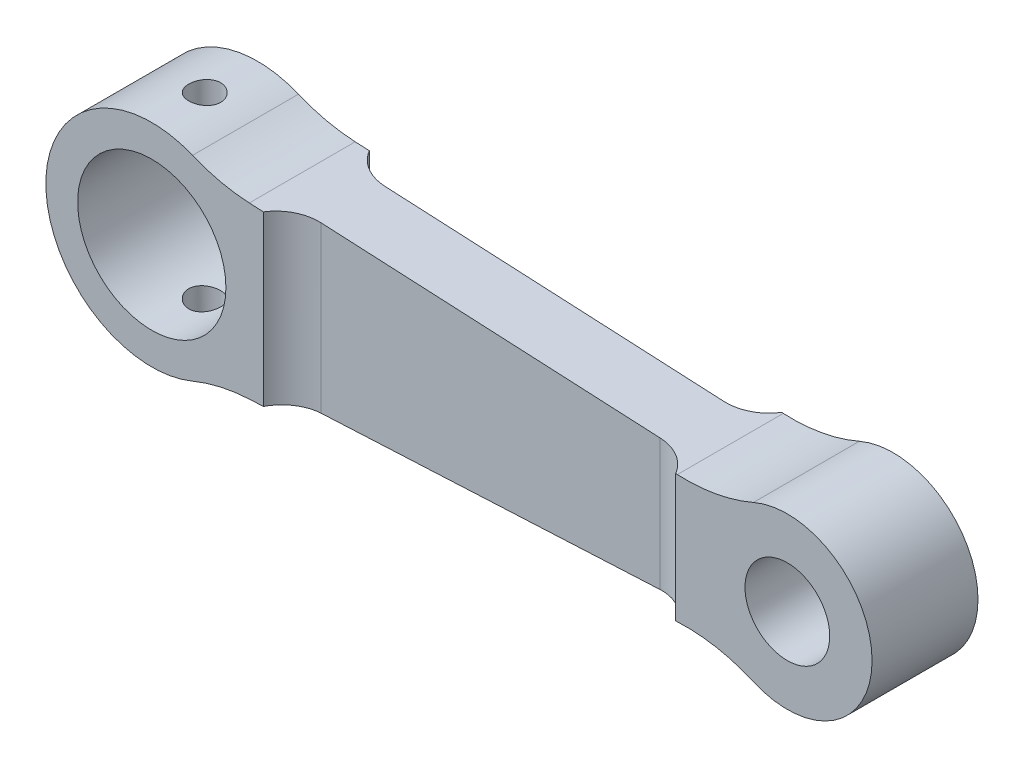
ISO-10303-21;
HEADER;
FILE_DESCRIPTION(('STEP AP214'),'2;1');
FILE_NAME('part.step','',(''),(''),'','','');
FILE_SCHEMA(('AUTOMOTIVE_DESIGN { 1 0 10303 214 1 1 1 1 }'));
ENDSEC;
DATA;
#1=APPLICATION_CONTEXT('core data for automotive mechanical design processes');
#2=APPLICATION_PROTOCOL_DEFINITION('international standard','automotive_design',2000,#1);
#3=PRODUCT_CONTEXT('',#1,'mechanical');
#4=PRODUCT('Part','Part','',(#3));
#5=PRODUCT_RELATED_PRODUCT_CATEGORY('part','',(#4));
#6=PRODUCT_DEFINITION_FORMATION('','',#4);
#7=PRODUCT_DEFINITION_CONTEXT('part definition',#1,'design');
#8=PRODUCT_DEFINITION('design','',#6,#7);
#9=PRODUCT_DEFINITION_SHAPE('','',#8);
#10=(LENGTH_UNIT() NAMED_UNIT(*) SI_UNIT(.MILLI.,.METRE.));
#11=(NAMED_UNIT(*) PLANE_ANGLE_UNIT() SI_UNIT($,.RADIAN.));
#12=(NAMED_UNIT(*) SI_UNIT($,.STERADIAN.) SOLID_ANGLE_UNIT());
#13=UNCERTAINTY_MEASURE_WITH_UNIT(LENGTH_MEASURE(1.E-05),#10,'distance_accuracy_value','');
#14=(GEOMETRIC_REPRESENTATION_CONTEXT(3) GLOBAL_UNCERTAINTY_ASSIGNED_CONTEXT((#13)) GLOBAL_UNIT_ASSIGNED_CONTEXT((#10,
#11,#12)) REPRESENTATION_CONTEXT('',''));
#15=CARTESIAN_POINT('',(0.,0.,0.));
#16=DIRECTION('',(0.,0.,1.));
#17=DIRECTION('',(1.,0.,0.));
#18=AXIS2_PLACEMENT_3D('',#15,#16,#17);
#19=CARTESIAN_POINT('',(5.,-12.,2.5));
#20=DIRECTION('',(0.,0.,-1.));
#21=DIRECTION('',(-1.,0.,0.));
#22=AXIS2_PLACEMENT_3D('',#19,#20,#21);
#23=PLANE('',#22);
#24=CARTESIAN_POINT('',(0.,0.,2.5));
#25=DIRECTION('',(0.,0.,1.));
#26=DIRECTION('',(1.,0.,0.));
#27=AXIS2_PLACEMENT_3D('',#24,#25,#26);
#28=CIRCLE('',#27,3.5);
#29=CARTESIAN_POINT('',(3.5,0.,2.5));
#30=VERTEX_POINT('',#29);
#31=EDGE_CURVE('E204',#30,#30,#28,.T.);
#32=ORIENTED_EDGE('',*,*,#31,.F.);
#33=EDGE_LOOP('',(#32));
#34=FACE_BOUND('',#33,.T.);
#35=DIRECTION('',(0.998777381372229,0.0494342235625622,0.));
#36=VECTOR('',#35,1.);
#37=CARTESIAN_POINT('',(4.60452621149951,-4.00978094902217,2.5));
#38=LINE('',#37,#36);
#39=CARTESIAN_POINT('',(4.60452621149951,-4.00978094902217,2.5));
#40=VERTEX_POINT('',#39);
#41=CARTESIAN_POINT('',(5.26794919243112,-3.97694500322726,2.5));
#42=VERTEX_POINT('',#41);
#43=EDGE_CURVE('E237',#40,#42,#38,.T.);
#44=ORIENTED_EDGE('',*,*,#43,.T.);
#45=DIRECTION('',(0.,1.,0.));
#46=VECTOR('',#45,1.);
#47=CARTESIAN_POINT('',(5.26794919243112,-10.,2.5));
#48=LINE('',#47,#46);
#49=CARTESIAN_POINT('',(5.26794919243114,3.97694500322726,2.5));
#50=VERTEX_POINT('',#49);
#51=EDGE_CURVE('E165',#42,#50,#48,.T.);
#52=ORIENTED_EDGE('',*,*,#51,.T.);
#53=DIRECTION('',(-0.998777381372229,0.049434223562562,0.));
#54=VECTOR('',#53,1.);
#55=CARTESIAN_POINT('',(24.8086946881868,3.00978094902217,2.5));
#56=LINE('',#55,#54);
#57=CARTESIAN_POINT('',(4.6045262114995,4.00978094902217,2.5));
#58=VERTEX_POINT('',#57);
#59=EDGE_CURVE('E246',#50,#58,#56,.T.);
#60=ORIENTED_EDGE('',*,*,#59,.T.);
#61=CARTESIAN_POINT('',(5.,12.,2.5));
#62=DIRECTION('',(0.,0.,-1.));
#63=DIRECTION('',(1.,0.,0.));
#64=AXIS2_PLACEMENT_3D('',#61,#62,#63);
#65=CIRCLE('',#64,8.);
#66=CARTESIAN_POINT('',(1.92307692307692,4.61538461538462,2.5));
#67=VERTEX_POINT('',#66);
#68=EDGE_CURVE('E250',#58,#67,#65,.T.);
#69=ORIENTED_EDGE('',*,*,#68,.T.);
#70=CARTESIAN_POINT('',(0.,0.,2.5));
#71=DIRECTION('',(0.,0.,1.));
#72=DIRECTION('',(1.,0.,0.));
#73=AXIS2_PLACEMENT_3D('',#70,#71,#72);
#74=CIRCLE('',#73,5.);
#75=CARTESIAN_POINT('',(1.92307692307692,-4.61538461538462,2.5));
#76=VERTEX_POINT('',#75);
#77=EDGE_CURVE('E252',#67,#76,#74,.T.);
#78=ORIENTED_EDGE('',*,*,#77,.T.);
#79=CARTESIAN_POINT('',(5.,-12.,2.5));
#80=DIRECTION('',(0.,0.,-1.));
#81=DIRECTION('',(-1.,0.,0.));
#82=AXIS2_PLACEMENT_3D('',#79,#80,#81);
#83=CIRCLE('',#82,8.);
#84=EDGE_CURVE('E234',#76,#40,#83,.T.);
#85=ORIENTED_EDGE('',*,*,#84,.T.);
#86=EDGE_LOOP('',(#44,#52,#60,#69,#78,#85));
#87=FACE_BOUND('',#86,.T.);
#88=ADVANCED_FACE('F34',(#34,#87),#23,.F.);
#89=CARTESIAN_POINT('',(5.,-12.,-2.5));
#90=DIRECTION('',(0.,0.,-1.));
#91=DIRECTION('',(-1.,0.,0.));
#92=AXIS2_PLACEMENT_3D('',#89,#90,#91);
#93=PLANE('',#92);
#94=DIRECTION('',(0.,1.,0.));
#95=VECTOR('',#94,1.);
#96=CARTESIAN_POINT('',(24.7320508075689,-10.,-2.5));
#97=LINE('',#96,#95);
#98=CARTESIAN_POINT('',(24.7320508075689,3.01357441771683,-2.5));
#99=VERTEX_POINT('',#98);
#100=CARTESIAN_POINT('',(24.7320508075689,-3.01357441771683,-2.5));
#101=VERTEX_POINT('',#100);
#102=EDGE_CURVE('E196',#99,#101,#97,.F.);
#103=ORIENTED_EDGE('',*,*,#102,.F.);
#104=DIRECTION('',(-0.998777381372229,0.049434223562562,0.));
#105=VECTOR('',#104,1.);
#106=CARTESIAN_POINT('',(24.8086946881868,3.00978094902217,-2.5));
#107=LINE('',#106,#105);
#108=CARTESIAN_POINT('',(24.8086946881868,3.00978094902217,-2.5));
#109=VERTEX_POINT('',#108);
#110=EDGE_CURVE('E227',#109,#99,#107,.T.);
#111=ORIENTED_EDGE('',*,*,#110,.F.);
#112=CARTESIAN_POINT('',(25.2041684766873,11.,-2.5));
#113=DIRECTION('',(0.,0.,-1.));
#114=DIRECTION('',(1.,0.,0.));
#115=AXIS2_PLACEMENT_3D('',#112,#113,#114);
#116=CIRCLE('',#115,8.);
#117=CARTESIAN_POINT('',(28.4013894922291,3.66666666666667,-2.5));
#118=VERTEX_POINT('',#117);
#119=EDGE_CURVE('E224',#118,#109,#116,.T.);
#120=ORIENTED_EDGE('',*,*,#119,.F.);
#121=CARTESIAN_POINT('',(30.,0.,-2.5));
#122=DIRECTION('',(0.,0.,1.));
#123=DIRECTION('',(1.,0.,0.));
#124=AXIS2_PLACEMENT_3D('',#121,#122,#123);
#125=CIRCLE('',#124,4.);
#126=CARTESIAN_POINT('',(28.4013894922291,-3.66666666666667,-2.5));
#127=VERTEX_POINT('',#126);
#128=EDGE_CURVE('E222',#127,#118,#125,.T.);
#129=ORIENTED_EDGE('',*,*,#128,.F.);
#130=CARTESIAN_POINT('',(25.2041684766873,-11.,-2.5));
#131=DIRECTION('',(0.,0.,-1.));
#132=DIRECTION('',(-1.,0.,0.));
#133=AXIS2_PLACEMENT_3D('',#130,#131,#132);
#134=CIRCLE('',#133,8.);
#135=CARTESIAN_POINT('',(24.8086946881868,-3.00978094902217,-2.5));
#136=VERTEX_POINT('',#135);
#137=EDGE_CURVE('E220',#136,#127,#134,.T.);
#138=ORIENTED_EDGE('',*,*,#137,.F.);
#139=DIRECTION('',(0.998777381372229,0.0494342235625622,0.));
#140=VECTOR('',#139,1.);
#141=CARTESIAN_POINT('',(4.60452621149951,-4.00978094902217,-2.5));
#142=LINE('',#141,#140);
#143=EDGE_CURVE('E216',#101,#136,#142,.T.);
#144=ORIENTED_EDGE('',*,*,#143,.F.);
#145=EDGE_LOOP('',(#103,#111,#120,#129,#138,#144));
#146=FACE_BOUND('',#145,.T.);
#147=CARTESIAN_POINT('',(30.,0.,-2.5));
#148=DIRECTION('',(0.,0.,1.));
#149=DIRECTION('',(1.,0.,0.));
#150=AXIS2_PLACEMENT_3D('',#147,#148,#149);
#151=CIRCLE('',#150,2.);
#152=CARTESIAN_POINT('',(32.,0.,-2.5));
#153=VERTEX_POINT('',#152);
#154=EDGE_CURVE('E207',#153,#153,#151,.T.);
#155=ORIENTED_EDGE('',*,*,#154,.T.);
#156=EDGE_LOOP('',(#155));
#157=FACE_BOUND('',#156,.T.);
#158=ADVANCED_FACE('F355',(#146,#157),#93,.T.);
#159=CARTESIAN_POINT('',(30.,0.,2.5));
#160=DIRECTION('',(0.,0.,1.));
#161=DIRECTION('',(1.,0.,0.));
#162=AXIS2_PLACEMENT_3D('',#159,#160,#161);
#163=CIRCLE('',#162,2.);
#164=CARTESIAN_POINT('',(32.,0.,2.5));
#165=VERTEX_POINT('',#164);
#166=EDGE_CURVE('E210',#165,#165,#163,.T.);
#167=ORIENTED_EDGE('',*,*,#166,.F.);
#168=EDGE_LOOP('',(#167));
#169=FACE_BOUND('',#168,.T.);
#170=CARTESIAN_POINT('',(24.8086946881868,3.00978094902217,2.5));
#171=VERTEX_POINT('',#170);
#172=CARTESIAN_POINT('',(24.7320508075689,3.01357441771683,2.5));
#173=VERTEX_POINT('',#172);
#174=EDGE_CURVE('E247',#171,#173,#56,.T.);
#175=ORIENTED_EDGE('',*,*,#174,.T.);
#176=DIRECTION('',(0.,1.,0.));
#177=VECTOR('',#176,1.);
#178=CARTESIAN_POINT('',(24.7320508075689,-10.,2.5));
#179=LINE('',#178,#177);
#180=CARTESIAN_POINT('',(24.7320508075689,-3.01357441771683,2.5));
#181=VERTEX_POINT('',#180);
#182=EDGE_CURVE('E56',#173,#181,#179,.F.);
#183=ORIENTED_EDGE('',*,*,#182,.T.);
#184=CARTESIAN_POINT('',(24.8086946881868,-3.00978094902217,2.5));
#185=VERTEX_POINT('',#184);
#186=EDGE_CURVE('E175',#181,#185,#38,.T.);
#187=ORIENTED_EDGE('',*,*,#186,.T.);
#188=CARTESIAN_POINT('',(25.2041684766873,-11.,2.5));
#189=DIRECTION('',(0.,0.,-1.));
#190=DIRECTION('',(-1.,0.,0.));
#191=AXIS2_PLACEMENT_3D('',#188,#189,#190);
#192=CIRCLE('',#191,8.);
#193=CARTESIAN_POINT('',(28.4013894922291,-3.66666666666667,2.5));
#194=VERTEX_POINT('',#193);
#195=EDGE_CURVE('E240',#185,#194,#192,.T.);
#196=ORIENTED_EDGE('',*,*,#195,.T.);
#197=CARTESIAN_POINT('',(30.,0.,2.5));
#198=DIRECTION('',(0.,0.,1.));
#199=DIRECTION('',(1.,0.,0.));
#200=AXIS2_PLACEMENT_3D('',#197,#198,#199);
#201=CIRCLE('',#200,4.);
#202=CARTESIAN_POINT('',(28.4013894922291,3.66666666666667,2.5));
#203=VERTEX_POINT('',#202);
#204=EDGE_CURVE('E242',#194,#203,#201,.T.);
#205=ORIENTED_EDGE('',*,*,#204,.T.);
#206=CARTESIAN_POINT('',(25.2041684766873,11.,2.5));
#207=DIRECTION('',(0.,0.,-1.));
#208=DIRECTION('',(1.,0.,0.));
#209=AXIS2_PLACEMENT_3D('',#206,#207,#208);
#210=CIRCLE('',#209,8.);
#211=EDGE_CURVE('E244',#203,#171,#210,.T.);
#212=ORIENTED_EDGE('',*,*,#211,.T.);
#213=EDGE_LOOP('',(#175,#183,#187,#196,#205,#212));
#214=FACE_BOUND('',#213,.T.);
#215=ADVANCED_FACE('F327',(#169,#214),#23,.F.);
#216=DIRECTION('',(0.,1.,0.));
#217=VECTOR('',#216,1.);
#218=CARTESIAN_POINT('',(5.26794919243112,-10.,-2.5));
#219=LINE('',#218,#217);
#220=CARTESIAN_POINT('',(5.26794919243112,-3.97694500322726,-2.5));
#221=VERTEX_POINT('',#220);
#222=CARTESIAN_POINT('',(5.26794919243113,3.97694500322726,-2.5));
#223=VERTEX_POINT('',#222);
#224=EDGE_CURVE('E64',#221,#223,#219,.T.);
#225=ORIENTED_EDGE('',*,*,#224,.F.);
#226=CARTESIAN_POINT('',(4.60452621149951,-4.00978094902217,-2.5));
#227=VERTEX_POINT('',#226);
#228=EDGE_CURVE('E217',#227,#221,#142,.T.);
#229=ORIENTED_EDGE('',*,*,#228,.F.);
#230=CARTESIAN_POINT('',(5.,-12.,-2.5));
#231=DIRECTION('',(0.,0.,-1.));
#232=DIRECTION('',(-1.,0.,0.));
#233=AXIS2_PLACEMENT_3D('',#230,#231,#232);
#234=CIRCLE('',#233,8.);
#235=CARTESIAN_POINT('',(1.92307692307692,-4.61538461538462,-2.5));
#236=VERTEX_POINT('',#235);
#237=EDGE_CURVE('E213',#236,#227,#234,.T.);
#238=ORIENTED_EDGE('',*,*,#237,.F.);
#239=CARTESIAN_POINT('',(0.,0.,-2.5));
#240=DIRECTION('',(0.,0.,1.));
#241=DIRECTION('',(1.,0.,0.));
#242=AXIS2_PLACEMENT_3D('',#239,#240,#241);
#243=CIRCLE('',#242,5.);
#244=CARTESIAN_POINT('',(1.92307692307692,4.61538461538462,-2.5));
#245=VERTEX_POINT('',#244);
#246=EDGE_CURVE('E232',#245,#236,#243,.T.);
#247=ORIENTED_EDGE('',*,*,#246,.F.);
#248=CARTESIAN_POINT('',(5.,12.,-2.5));
#249=DIRECTION('',(0.,0.,-1.));
#250=DIRECTION('',(1.,0.,0.));
#251=AXIS2_PLACEMENT_3D('',#248,#249,#250);
#252=CIRCLE('',#251,8.);
#253=CARTESIAN_POINT('',(4.6045262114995,4.00978094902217,-2.5));
#254=VERTEX_POINT('',#253);
#255=EDGE_CURVE('E230',#254,#245,#252,.T.);
#256=ORIENTED_EDGE('',*,*,#255,.F.);
#257=EDGE_CURVE('E226',#223,#254,#107,.T.);
#258=ORIENTED_EDGE('',*,*,#257,.F.);
#259=EDGE_LOOP('',(#225,#229,#238,#247,#256,#258));
#260=FACE_BOUND('',#259,.T.);
#261=CARTESIAN_POINT('',(0.,0.,-2.5));
#262=DIRECTION('',(0.,0.,1.));
#263=DIRECTION('',(1.,0.,0.));
#264=AXIS2_PLACEMENT_3D('',#261,#262,#263);
#265=CIRCLE('',#264,3.5);
#266=CARTESIAN_POINT('',(3.5,0.,-2.5));
#267=VERTEX_POINT('',#266);
#268=EDGE_CURVE('E201',#267,#267,#265,.T.);
#269=ORIENTED_EDGE('',*,*,#268,.T.);
#270=EDGE_LOOP('',(#269));
#271=FACE_BOUND('',#270,.T.);
#272=ADVANCED_FACE('F352',(#260,#271),#93,.T.);
#273=CARTESIAN_POINT('',(5.,-12.,2.5));
#274=DIRECTION('',(0.,0.,-1.));
#275=DIRECTION('',(-1.,0.,0.));
#276=AXIS2_PLACEMENT_3D('',#273,#274,#275);
#277=CYLINDRICAL_SURFACE('',#276,8.);
#278=ORIENTED_EDGE('',*,*,#237,.T.);
#279=DIRECTION('',(0.,0.,-1.));
#280=VECTOR('',#279,1.);
#281=CARTESIAN_POINT('',(4.60452621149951,-4.00978094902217,2.5));
#282=LINE('',#281,#280);
#283=EDGE_CURVE('E275',#40,#227,#282,.T.);
#284=ORIENTED_EDGE('',*,*,#283,.F.);
#285=ORIENTED_EDGE('',*,*,#84,.F.);
#286=DIRECTION('',(0.,0.,-1.));
#287=VECTOR('',#286,1.);
#288=CARTESIAN_POINT('',(1.92307692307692,-4.61538461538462,2.5));
#289=LINE('',#288,#287);
#290=EDGE_CURVE('E254',#76,#236,#289,.T.);
#291=ORIENTED_EDGE('',*,*,#290,.T.);
#292=EDGE_LOOP('',(#278,#284,#285,#291));
#293=FACE_BOUND('',#292,.T.);
#294=ADVANCED_FACE('F36',(#293),#277,.F.);
#295=CARTESIAN_POINT('',(4.60452621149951,-4.00978094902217,2.5));
#296=DIRECTION('',(-0.0494342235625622,0.998777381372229,0.));
#297=DIRECTION('',(-0.998777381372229,-0.0494342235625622,0.));
#298=AXIS2_PLACEMENT_3D('',#295,#296,#297);
#299=PLANE('',#298);
#300=DIRECTION('',(-0.998777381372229,-0.0494342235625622,0.));
#301=VECTOR('',#300,1.);
#302=CARTESIAN_POINT('',(4.60452621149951,-4.00978094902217,1.5));
#303=LINE('',#302,#301);
#304=CARTESIAN_POINT('',(23.,-3.09930181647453,1.5));
#305=VERTEX_POINT('',#304);
#306=CARTESIAN_POINT('',(7.00000000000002,-3.89121760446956,1.5));
#307=VERTEX_POINT('',#306);
#308=EDGE_CURVE('E155',#305,#307,#303,.T.);
#309=ORIENTED_EDGE('',*,*,#308,.T.);
#310=CARTESIAN_POINT('',(7.,-3.89121760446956,3.5));
#311=DIRECTION('',(-0.0494342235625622,0.998777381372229,0.));
#312=DIRECTION('',(0.998777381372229,0.0494342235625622,0.));
#313=AXIS2_PLACEMENT_3D('',#310,#311,#312);
#314=ELLIPSE('',#313,2.00244823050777,2.);
#315=EDGE_CURVE('E181',#307,#42,#314,.T.);
#316=ORIENTED_EDGE('',*,*,#315,.T.);
#317=ORIENTED_EDGE('',*,*,#43,.F.);
#318=ORIENTED_EDGE('',*,*,#283,.T.);
#319=ORIENTED_EDGE('',*,*,#228,.T.);
#320=CARTESIAN_POINT('',(7.,-3.89121760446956,-3.5));
#321=DIRECTION('',(-0.0494342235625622,0.998777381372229,0.));
#322=DIRECTION('',(0.998777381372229,0.0494342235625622,0.));
#323=AXIS2_PLACEMENT_3D('',#320,#321,#322);
#324=ELLIPSE('',#323,2.00244823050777,2.);
#325=CARTESIAN_POINT('',(7.00000000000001,-3.89121760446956,-1.5));
#326=VERTEX_POINT('',#325);
#327=EDGE_CURVE('E190',#221,#326,#324,.T.);
#328=ORIENTED_EDGE('',*,*,#327,.T.);
#329=DIRECTION('',(0.998777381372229,0.0494342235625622,0.));
#330=VECTOR('',#329,1.);
#331=CARTESIAN_POINT('',(4.60452621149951,-4.00978094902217,-1.5));
#332=LINE('',#331,#330);
#333=CARTESIAN_POINT('',(23.,-3.09930181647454,-1.5));
#334=VERTEX_POINT('',#333);
#335=EDGE_CURVE('E193',#326,#334,#332,.T.);
#336=ORIENTED_EDGE('',*,*,#335,.T.);
#337=CARTESIAN_POINT('',(23.,-3.09930181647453,-3.5));
#338=DIRECTION('',(-0.0494342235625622,0.998777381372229,0.));
#339=DIRECTION('',(0.998777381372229,0.0494342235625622,0.));
#340=AXIS2_PLACEMENT_3D('',#337,#338,#339);
#341=ELLIPSE('',#340,2.00244823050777,2.);
#342=EDGE_CURVE('E198',#334,#101,#341,.T.);
#343=ORIENTED_EDGE('',*,*,#342,.T.);
#344=ORIENTED_EDGE('',*,*,#143,.T.);
#345=DIRECTION('',(0.,0.,-1.));
#346=VECTOR('',#345,1.);
#347=CARTESIAN_POINT('',(24.8086946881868,-3.00978094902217,2.5));
#348=LINE('',#347,#346);
#349=EDGE_CURVE('E272',#185,#136,#348,.T.);
#350=ORIENTED_EDGE('',*,*,#349,.F.);
#351=ORIENTED_EDGE('',*,*,#186,.F.);
#352=CARTESIAN_POINT('',(23.,-3.09930181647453,3.5));
#353=DIRECTION('',(-0.0494342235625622,0.998777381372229,0.));
#354=DIRECTION('',(0.998777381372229,0.0494342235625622,0.));
#355=AXIS2_PLACEMENT_3D('',#352,#353,#354);
#356=ELLIPSE('',#355,2.00244823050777,2.);
#357=EDGE_CURVE('E166',#181,#305,#356,.T.);
#358=ORIENTED_EDGE('',*,*,#357,.T.);
#359=EDGE_LOOP('',(#309,#316,#317,#318,#319,#328,#336,#343,#344,#350,#351,#358));
#360=FACE_BOUND('',#359,.T.);
#361=ADVANCED_FACE('F173',(#360),#299,.F.);
#362=CARTESIAN_POINT('',(25.2041684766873,-11.,2.5));
#363=DIRECTION('',(0.,0.,-1.));
#364=DIRECTION('',(-1.,0.,0.));
#365=AXIS2_PLACEMENT_3D('',#362,#363,#364);
#366=CYLINDRICAL_SURFACE('',#365,8.);
#367=ORIENTED_EDGE('',*,*,#137,.T.);
#368=DIRECTION('',(0.,0.,-1.));
#369=VECTOR('',#368,1.);
#370=CARTESIAN_POINT('',(28.4013894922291,-3.66666666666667,2.5));
#371=LINE('',#370,#369);
#372=EDGE_CURVE('E269',#194,#127,#371,.T.);
#373=ORIENTED_EDGE('',*,*,#372,.F.);
#374=ORIENTED_EDGE('',*,*,#195,.F.);
#375=ORIENTED_EDGE('',*,*,#349,.T.);
#376=EDGE_LOOP('',(#367,#373,#374,#375));
#377=FACE_BOUND('',#376,.T.);
#378=ADVANCED_FACE('F344',(#377),#366,.F.);
#379=CARTESIAN_POINT('',(30.,0.,2.5));
#380=DIRECTION('',(0.,0.,-1.));
#381=DIRECTION('',(-1.,0.,0.));
#382=AXIS2_PLACEMENT_3D('',#379,#380,#381);
#383=CYLINDRICAL_SURFACE('',#382,4.);
#384=ORIENTED_EDGE('',*,*,#128,.T.);
#385=DIRECTION('',(0.,0.,-1.));
#386=VECTOR('',#385,1.);
#387=CARTESIAN_POINT('',(28.4013894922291,3.66666666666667,2.5));
#388=LINE('',#387,#386);
#389=EDGE_CURVE('E266',#203,#118,#388,.T.);
#390=ORIENTED_EDGE('',*,*,#389,.F.);
#391=ORIENTED_EDGE('',*,*,#204,.F.);
#392=ORIENTED_EDGE('',*,*,#372,.T.);
#393=EDGE_LOOP('',(#384,#390,#391,#392));
#394=FACE_BOUND('',#393,.T.);
#395=ADVANCED_FACE('F340',(#394),#383,.T.);
#396=CARTESIAN_POINT('',(25.2041684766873,11.,2.5));
#397=DIRECTION('',(0.,0.,-1.));
#398=DIRECTION('',(-1.,0.,0.));
#399=AXIS2_PLACEMENT_3D('',#396,#397,#398);
#400=CYLINDRICAL_SURFACE('',#399,8.);
#401=ORIENTED_EDGE('',*,*,#119,.T.);
#402=DIRECTION('',(0.,0.,-1.));
#403=VECTOR('',#402,1.);
#404=CARTESIAN_POINT('',(24.8086946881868,3.00978094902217,2.5));
#405=LINE('',#404,#403);
#406=EDGE_CURVE('E263',#171,#109,#405,.T.);
#407=ORIENTED_EDGE('',*,*,#406,.F.);
#408=ORIENTED_EDGE('',*,*,#211,.F.);
#409=ORIENTED_EDGE('',*,*,#389,.T.);
#410=EDGE_LOOP('',(#401,#407,#408,#409));
#411=FACE_BOUND('',#410,.T.);
#412=ADVANCED_FACE('F336',(#411),#400,.F.);
#413=CARTESIAN_POINT('',(24.8086946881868,3.00978094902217,2.5));
#414=DIRECTION('',(-0.049434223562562,-0.998777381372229,0.));
#415=DIRECTION('',(0.998777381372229,-0.049434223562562,0.));
#416=AXIS2_PLACEMENT_3D('',#413,#414,#415);
#417=PLANE('',#416);
#418=ORIENTED_EDGE('',*,*,#59,.F.);
#419=CARTESIAN_POINT('',(7.,3.89121760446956,3.5));
#420=DIRECTION('',(-0.049434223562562,-0.998777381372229,0.));
#421=DIRECTION('',(-0.998777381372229,0.049434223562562,0.));
#422=AXIS2_PLACEMENT_3D('',#419,#420,#421);
#423=ELLIPSE('',#422,2.00244823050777,2.);
#424=CARTESIAN_POINT('',(7.00000000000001,3.89121760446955,1.5));
#425=VERTEX_POINT('',#424);
#426=EDGE_CURVE('E11',#50,#425,#423,.T.);
#427=ORIENTED_EDGE('',*,*,#426,.T.);
#428=DIRECTION('',(0.998777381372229,-0.049434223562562,0.));
#429=VECTOR('',#428,1.);
#430=CARTESIAN_POINT('',(24.8086946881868,3.00978094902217,1.5));
#431=LINE('',#430,#429);
#432=CARTESIAN_POINT('',(23.,3.09930181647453,1.5));
#433=VERTEX_POINT('',#432);
#434=EDGE_CURVE('E48',#425,#433,#431,.T.);
#435=ORIENTED_EDGE('',*,*,#434,.T.);
#436=CARTESIAN_POINT('',(23.,3.09930181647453,3.5));
#437=DIRECTION('',(-0.049434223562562,-0.998777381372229,0.));
#438=DIRECTION('',(-0.998777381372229,0.049434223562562,0.));
#439=AXIS2_PLACEMENT_3D('',#436,#437,#438);
#440=ELLIPSE('',#439,2.00244823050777,2.);
#441=EDGE_CURVE('E169',#433,#173,#440,.T.);
#442=ORIENTED_EDGE('',*,*,#441,.T.);
#443=ORIENTED_EDGE('',*,*,#174,.F.);
#444=ORIENTED_EDGE('',*,*,#406,.T.);
#445=ORIENTED_EDGE('',*,*,#110,.T.);
#446=CARTESIAN_POINT('',(23.,3.09930181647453,-3.5));
#447=DIRECTION('',(-0.049434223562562,-0.998777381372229,0.));
#448=DIRECTION('',(-0.998777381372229,0.049434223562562,0.));
#449=AXIS2_PLACEMENT_3D('',#446,#447,#448);
#450=ELLIPSE('',#449,2.00244823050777,2.);
#451=CARTESIAN_POINT('',(23.,3.09930181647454,-1.5));
#452=VERTEX_POINT('',#451);
#453=EDGE_CURVE('E283',#99,#452,#450,.T.);
#454=ORIENTED_EDGE('',*,*,#453,.T.);
#455=DIRECTION('',(-0.998777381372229,0.049434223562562,0.));
#456=VECTOR('',#455,1.);
#457=CARTESIAN_POINT('',(24.8086946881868,3.00978094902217,-1.5));
#458=LINE('',#457,#456);
#459=CARTESIAN_POINT('',(7.00000000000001,3.89121760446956,-1.5));
#460=VERTEX_POINT('',#459);
#461=EDGE_CURVE('E280',#452,#460,#458,.T.);
#462=ORIENTED_EDGE('',*,*,#461,.T.);
#463=CARTESIAN_POINT('',(7.,3.89121760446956,-3.5));
#464=DIRECTION('',(-0.049434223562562,-0.998777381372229,0.));
#465=DIRECTION('',(-0.998777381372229,0.049434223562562,0.));
#466=AXIS2_PLACEMENT_3D('',#463,#464,#465);
#467=ELLIPSE('',#466,2.00244823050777,2.);
#468=EDGE_CURVE('E278',#460,#223,#467,.T.);
#469=ORIENTED_EDGE('',*,*,#468,.T.);
#470=ORIENTED_EDGE('',*,*,#257,.T.);
#471=DIRECTION('',(0.,0.,-1.));
#472=VECTOR('',#471,1.);
#473=CARTESIAN_POINT('',(4.6045262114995,4.00978094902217,2.5));
#474=LINE('',#473,#472);
#475=EDGE_CURVE('E260',#58,#254,#474,.T.);
#476=ORIENTED_EDGE('',*,*,#475,.F.);
#477=EDGE_LOOP('',(#418,#427,#435,#442,#443,#444,#445,#454,#462,#469,#470,#476));
#478=FACE_BOUND('',#477,.T.);
#479=ADVANCED_FACE('F332',(#478),#417,.F.);
#480=CARTESIAN_POINT('',(5.,12.,2.5));
#481=DIRECTION('',(0.,0.,-1.));
#482=DIRECTION('',(-1.,0.,0.));
#483=AXIS2_PLACEMENT_3D('',#480,#481,#482);
#484=CYLINDRICAL_SURFACE('',#483,8.);
#485=ORIENTED_EDGE('',*,*,#255,.T.);
#486=DIRECTION('',(0.,0.,-1.));
#487=VECTOR('',#486,1.);
#488=CARTESIAN_POINT('',(1.92307692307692,4.61538461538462,2.5));
#489=LINE('',#488,#487);
#490=EDGE_CURVE('E257',#67,#245,#489,.T.);
#491=ORIENTED_EDGE('',*,*,#490,.F.);
#492=ORIENTED_EDGE('',*,*,#68,.F.);
#493=ORIENTED_EDGE('',*,*,#475,.T.);
#494=EDGE_LOOP('',(#485,#491,#492,#493));
#495=FACE_BOUND('',#494,.T.);
#496=ADVANCED_FACE('F325',(#495),#484,.F.);
#497=CARTESIAN_POINT('',(0.,0.,2.5));
#498=DIRECTION('',(0.,0.,-1.));
#499=DIRECTION('',(-1.,0.,0.));
#500=AXIS2_PLACEMENT_3D('',#497,#498,#499);
#501=CYLINDRICAL_SURFACE('',#500,5.);
#502=CARTESIAN_POINT('',(0.,-5.,0.75));
#503=CARTESIAN_POINT('',(0.0418757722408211,-4.99999932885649,0.749998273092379));
#504=CARTESIAN_POINT('',(0.0837758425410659,-4.9994684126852,0.746480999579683));
#505=CARTESIAN_POINT('',(0.166404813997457,-4.99740157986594,0.732508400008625));
#506=CARTESIAN_POINT('',(0.207132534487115,-4.99586468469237,0.722046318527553));
#507=CARTESIAN_POINT('',(0.28620904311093,-4.99195860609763,0.694503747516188));
#508=CARTESIAN_POINT('',(0.324559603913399,-4.9895900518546,0.677428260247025));
#509=CARTESIAN_POINT('',(0.397845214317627,-4.98428237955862,0.637155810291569));
#510=CARTESIAN_POINT('',(0.432780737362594,-4.98134334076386,0.613959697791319));
#511=CARTESIAN_POINT('',(0.498523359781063,-4.97519585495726,0.561911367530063));
#512=CARTESIAN_POINT('',(0.52929991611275,-4.97198566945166,0.533020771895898));
#513=CARTESIAN_POINT('',(0.585587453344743,-4.96567130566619,0.470486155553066));
#514=CARTESIAN_POINT('',(0.611098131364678,-4.96256713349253,0.43684186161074));
#515=CARTESIAN_POINT('',(0.656248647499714,-4.95679938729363,0.365549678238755));
#516=CARTESIAN_POINT('',(0.675858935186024,-4.95413805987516,0.327882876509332));
#517=CARTESIAN_POINT('',(0.70846316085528,-4.94958105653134,0.249743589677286));
#518=CARTESIAN_POINT('',(0.721457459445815,-4.94768533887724,0.209271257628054));
#519=CARTESIAN_POINT('',(0.740365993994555,-4.94489128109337,0.126990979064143));
#520=CARTESIAN_POINT('',(0.746332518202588,-4.94398557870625,0.0851953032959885));
#521=CARTESIAN_POINT('',(0.751178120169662,-4.94325174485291,0.00118691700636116));
#522=CARTESIAN_POINT('',(0.750057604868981,-4.94342355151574,-0.0410257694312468));
#523=CARTESIAN_POINT('',(0.740803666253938,-4.94481859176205,-0.124300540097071));
#524=CARTESIAN_POINT('',(0.732728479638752,-4.94603309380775,-0.165369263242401));
#525=CARTESIAN_POINT('',(0.709885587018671,-4.94936304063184,-0.245562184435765));
#526=CARTESIAN_POINT('',(0.69511769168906,-4.9514785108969,-0.284686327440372));
#527=CARTESIAN_POINT('',(0.659248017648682,-4.9563816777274,-0.360056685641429));
#528=CARTESIAN_POINT('',(0.638121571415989,-4.95917198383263,-0.396290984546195));
#529=CARTESIAN_POINT('',(0.590152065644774,-4.96510853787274,-0.464722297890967));
#530=CARTESIAN_POINT('',(0.563308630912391,-4.9682548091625,-0.496919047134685));
#531=CARTESIAN_POINT('',(0.504347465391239,-4.97458736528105,-0.556698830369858));
#532=CARTESIAN_POINT('',(0.472179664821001,-4.97777373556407,-0.58423249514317));
#533=CARTESIAN_POINT('',(0.403653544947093,-4.98379823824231,-0.633517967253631));
#534=CARTESIAN_POINT('',(0.367295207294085,-4.98663636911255,-0.655269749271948));
#535=CARTESIAN_POINT('',(0.291377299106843,-4.99164757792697,-0.692376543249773));
#536=CARTESIAN_POINT('',(0.25181583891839,-4.99382025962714,-0.707727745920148));
#537=CARTESIAN_POINT('',(0.17063659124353,-4.99725245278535,-0.731554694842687));
#538=CARTESIAN_POINT('',(0.1290189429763,-4.99851202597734,-0.740030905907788));
#539=CARTESIAN_POINT('',(0.0453347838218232,-4.99996790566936,-0.749801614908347));
#540=CARTESIAN_POINT('',(0.00327636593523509,-5.00017426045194,-0.751163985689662));
#541=CARTESIAN_POINT('',(-0.0804683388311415,-4.99952780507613,-0.746848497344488));
#542=CARTESIAN_POINT('',(-0.122154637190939,-4.99867502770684,-0.741170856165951));
#543=CARTESIAN_POINT('',(-0.203766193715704,-4.99601234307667,-0.722992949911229));
#544=CARTESIAN_POINT('',(-0.243698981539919,-4.99420707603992,-0.710525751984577));
#545=CARTESIAN_POINT('',(-0.3209074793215,-4.98984117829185,-0.679157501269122));
#546=CARTESIAN_POINT('',(-0.35818306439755,-4.98728051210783,-0.660256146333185));
#547=CARTESIAN_POINT('',(-0.429317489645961,-4.98166341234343,-0.61639688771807));
#548=CARTESIAN_POINT('',(-0.463149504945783,-4.97860350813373,-0.591395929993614));
#549=CARTESIAN_POINT('',(-0.526161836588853,-4.97233931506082,-0.536107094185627));
#550=CARTESIAN_POINT('',(-0.555341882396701,-4.96913501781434,-0.505818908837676));
#551=CARTESIAN_POINT('',(-0.608468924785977,-4.96291132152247,-0.440513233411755));
#552=CARTESIAN_POINT('',(-0.632370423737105,-4.95989368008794,-0.405458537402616));
#553=CARTESIAN_POINT('',(-0.673945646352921,-4.95441609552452,-0.331791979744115));
#554=CARTESIAN_POINT('',(-0.691619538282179,-4.95195613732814,-0.293180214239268));
#555=CARTESIAN_POINT('',(-0.720167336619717,-4.94788516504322,-0.213631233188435));
#556=CARTESIAN_POINT('',(-0.731065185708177,-4.94627116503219,-0.172702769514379));
#557=CARTESIAN_POINT('',(-0.745827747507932,-4.94406691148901,-0.0895704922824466));
#558=CARTESIAN_POINT('',(-0.749692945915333,-4.94347658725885,-0.0473667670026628));
#559=CARTESIAN_POINT('',(-0.750268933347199,-4.94338916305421,0.036664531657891));
#560=CARTESIAN_POINT('',(-0.747051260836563,-4.94388113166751,0.0784916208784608));
#561=CARTESIAN_POINT('',(-0.733706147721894,-4.94587910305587,0.161002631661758));
#562=CARTESIAN_POINT('',(-0.723578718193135,-4.94738510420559,0.201686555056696));
#563=CARTESIAN_POINT('',(-0.696726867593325,-4.95123763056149,0.280736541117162));
#564=CARTESIAN_POINT('',(-0.68000744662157,-4.95358351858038,0.319104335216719));
#565=CARTESIAN_POINT('',(-0.640453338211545,-4.95885227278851,0.3925018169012));
#566=CARTESIAN_POINT('',(-0.617618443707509,-4.96177515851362,0.427531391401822));
#567=CARTESIAN_POINT('',(-0.56622168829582,-4.96790371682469,0.493621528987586));
#568=CARTESIAN_POINT('',(-0.537606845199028,-4.97111183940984,0.524640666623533));
#569=CARTESIAN_POINT('',(-0.475574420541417,-4.97742894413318,0.581462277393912));
#570=CARTESIAN_POINT('',(-0.44215572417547,-4.9805379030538,0.60726353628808));
#571=CARTESIAN_POINT('',(-0.371247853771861,-4.9863259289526,0.653043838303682));
#572=CARTESIAN_POINT('',(-0.33373728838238,-4.9890025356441,0.672990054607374));
#573=CARTESIAN_POINT('',(-0.255875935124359,-4.9936001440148,0.706269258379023));
#574=CARTESIAN_POINT('',(-0.215528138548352,-4.99552192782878,0.719609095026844));
#575=CARTESIAN_POINT('',(-0.145832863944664,-4.99795469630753,0.736270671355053));
#576=CARTESIAN_POINT('',(-0.116915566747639,-4.99871774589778,0.741411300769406));
#577=CARTESIAN_POINT('',(-0.0586694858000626,-4.99974062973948,0.748276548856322));
#578=CARTESIAN_POINT('',(-0.0293407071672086,-5.00000047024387,0.750001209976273));
#579=CARTESIAN_POINT('',(0.,-5.,0.75));
#580=B_SPLINE_CURVE_WITH_KNOTS('',3,(#502,#503,#504,#505,#506,#507,#508,#509,#510,#511,#512,
#513,#514,#515,#516,#517,#518,#519,#520,#521,#522,#523,#524,#525,#526,#527,#528,#529,#530,#531,
#532,#533,#534,#535,#536,#537,#538,#539,#540,#541,#542,#543,#544,#545,#546,#547,#548,#549,#550,
#551,#552,#553,#554,#555,#556,#557,#558,#559,#560,#561,#562,#563,#564,#565,#566,#567,#568,#569,
#570,#571,#572,#573,#574,#575,#576,#577,#578,#579),.UNSPECIFIED.,.T.,.F.,(4,2,2,2,2,2,2,2,2,2,2,
2,2,2,2,2,2,2,2,2,2,2,2,2,2,2,2,2,2,2,2,2,2,2,2,2,2,2,4),(0.,0.125520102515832,
0.251162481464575,0.376710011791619,0.5022401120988,0.628647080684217,0.7550613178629,
0.882098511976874,1.00912878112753,1.13520782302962,1.26127962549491,1.38630588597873,
1.51133568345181,1.63685691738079,1.76238639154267,1.88917145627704,2.01595707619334,
2.14281804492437,2.26967043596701,2.39531029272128,2.52094625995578,2.64597574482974,
2.77101110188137,2.89695594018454,3.02290810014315,3.14990683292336,3.27690213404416,
3.40344611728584,3.52998136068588,3.65524444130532,3.78050732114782,3.90567536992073,
4.0308476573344,4.1572241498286,4.28363001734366,4.41073161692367,4.53770116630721,
4.62564925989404,4.71359626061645),.UNSPECIFIED.);
#581=CARTESIAN_POINT('',(0.,-5.,0.75));
#582=VERTEX_POINT('',#581);
#583=EDGE_CURVE('E170',#582,#582,#580,.T.);
#584=ORIENTED_EDGE('',*,*,#583,.T.);
#585=EDGE_LOOP('',(#584));
#586=FACE_BOUND('',#585,.T.);
#587=CARTESIAN_POINT('',(0.,5.,0.75));
#588=CARTESIAN_POINT('',(-0.0418757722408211,4.99999932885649,0.749998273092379));
#589=CARTESIAN_POINT('',(-0.0837758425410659,4.9994684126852,0.746480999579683));
#590=CARTESIAN_POINT('',(-0.166404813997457,4.99740157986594,0.732508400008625));
#591=CARTESIAN_POINT('',(-0.207132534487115,4.99586468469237,0.722046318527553));
#592=CARTESIAN_POINT('',(-0.28620904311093,4.99195860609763,0.694503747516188));
#593=CARTESIAN_POINT('',(-0.324559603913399,4.9895900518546,0.677428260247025));
#594=CARTESIAN_POINT('',(-0.397845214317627,4.98428237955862,0.637155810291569));
#595=CARTESIAN_POINT('',(-0.432780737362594,4.98134334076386,0.613959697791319));
#596=CARTESIAN_POINT('',(-0.498523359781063,4.97519585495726,0.561911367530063));
#597=CARTESIAN_POINT('',(-0.52929991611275,4.97198566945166,0.533020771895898));
#598=CARTESIAN_POINT('',(-0.585587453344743,4.96567130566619,0.470486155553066));
#599=CARTESIAN_POINT('',(-0.611098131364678,4.96256713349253,0.43684186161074));
#600=CARTESIAN_POINT('',(-0.656248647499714,4.95679938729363,0.365549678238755));
#601=CARTESIAN_POINT('',(-0.675858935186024,4.95413805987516,0.327882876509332));
#602=CARTESIAN_POINT('',(-0.70846316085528,4.94958105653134,0.249743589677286));
#603=CARTESIAN_POINT('',(-0.721457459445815,4.94768533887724,0.209271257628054));
#604=CARTESIAN_POINT('',(-0.740365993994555,4.94489128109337,0.126990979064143));
#605=CARTESIAN_POINT('',(-0.746332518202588,4.94398557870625,0.0851953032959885));
#606=CARTESIAN_POINT('',(-0.751178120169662,4.94325174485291,0.00118691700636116));
#607=CARTESIAN_POINT('',(-0.750057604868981,4.94342355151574,-0.0410257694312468));
#608=CARTESIAN_POINT('',(-0.740803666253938,4.94481859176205,-0.124300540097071));
#609=CARTESIAN_POINT('',(-0.732728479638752,4.94603309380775,-0.165369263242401));
#610=CARTESIAN_POINT('',(-0.709885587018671,4.94936304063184,-0.245562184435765));
#611=CARTESIAN_POINT('',(-0.69511769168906,4.9514785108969,-0.284686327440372));
#612=CARTESIAN_POINT('',(-0.659248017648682,4.9563816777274,-0.360056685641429));
#613=CARTESIAN_POINT('',(-0.638121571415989,4.95917198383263,-0.396290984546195));
#614=CARTESIAN_POINT('',(-0.590152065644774,4.96510853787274,-0.464722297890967));
#615=CARTESIAN_POINT('',(-0.563308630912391,4.9682548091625,-0.496919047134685));
#616=CARTESIAN_POINT('',(-0.504347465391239,4.97458736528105,-0.556698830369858));
#617=CARTESIAN_POINT('',(-0.472179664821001,4.97777373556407,-0.58423249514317));
#618=CARTESIAN_POINT('',(-0.403653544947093,4.98379823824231,-0.633517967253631));
#619=CARTESIAN_POINT('',(-0.367295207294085,4.98663636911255,-0.655269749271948));
#620=CARTESIAN_POINT('',(-0.291377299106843,4.99164757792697,-0.692376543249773));
#621=CARTESIAN_POINT('',(-0.25181583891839,4.99382025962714,-0.707727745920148));
#622=CARTESIAN_POINT('',(-0.17063659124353,4.99725245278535,-0.731554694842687));
#623=CARTESIAN_POINT('',(-0.1290189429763,4.99851202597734,-0.740030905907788));
#624=CARTESIAN_POINT('',(-0.0453347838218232,4.99996790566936,-0.749801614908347));
#625=CARTESIAN_POINT('',(-0.00327636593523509,5.00017426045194,-0.751163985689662));
#626=CARTESIAN_POINT('',(0.0804683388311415,4.99952780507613,-0.746848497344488));
#627=CARTESIAN_POINT('',(0.122154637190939,4.99867502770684,-0.741170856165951));
#628=CARTESIAN_POINT('',(0.203766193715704,4.99601234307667,-0.722992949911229));
#629=CARTESIAN_POINT('',(0.243698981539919,4.99420707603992,-0.710525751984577));
#630=CARTESIAN_POINT('',(0.3209074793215,4.98984117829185,-0.679157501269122));
#631=CARTESIAN_POINT('',(0.35818306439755,4.98728051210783,-0.660256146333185));
#632=CARTESIAN_POINT('',(0.429317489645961,4.98166341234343,-0.61639688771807));
#633=CARTESIAN_POINT('',(0.463149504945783,4.97860350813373,-0.591395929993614));
#634=CARTESIAN_POINT('',(0.526161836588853,4.97233931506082,-0.536107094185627));
#635=CARTESIAN_POINT('',(0.555341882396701,4.96913501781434,-0.505818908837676));
#636=CARTESIAN_POINT('',(0.608468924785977,4.96291132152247,-0.440513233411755));
#637=CARTESIAN_POINT('',(0.632370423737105,4.95989368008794,-0.405458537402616));
#638=CARTESIAN_POINT('',(0.673945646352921,4.95441609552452,-0.331791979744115));
#639=CARTESIAN_POINT('',(0.691619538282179,4.95195613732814,-0.293180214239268));
#640=CARTESIAN_POINT('',(0.720167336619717,4.94788516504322,-0.213631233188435));
#641=CARTESIAN_POINT('',(0.731065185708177,4.94627116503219,-0.172702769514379));
#642=CARTESIAN_POINT('',(0.745827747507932,4.94406691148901,-0.0895704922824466));
#643=CARTESIAN_POINT('',(0.749692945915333,4.94347658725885,-0.0473667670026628));
#644=CARTESIAN_POINT('',(0.750268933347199,4.94338916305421,0.036664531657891));
#645=CARTESIAN_POINT('',(0.747051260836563,4.94388113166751,0.0784916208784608));
#646=CARTESIAN_POINT('',(0.733706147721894,4.94587910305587,0.161002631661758));
#647=CARTESIAN_POINT('',(0.723578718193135,4.94738510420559,0.201686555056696));
#648=CARTESIAN_POINT('',(0.696726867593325,4.95123763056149,0.280736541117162));
#649=CARTESIAN_POINT('',(0.68000744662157,4.95358351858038,0.319104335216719));
#650=CARTESIAN_POINT('',(0.640453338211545,4.95885227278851,0.3925018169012));
#651=CARTESIAN_POINT('',(0.617618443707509,4.96177515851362,0.427531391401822));
#652=CARTESIAN_POINT('',(0.56622168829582,4.96790371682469,0.493621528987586));
#653=CARTESIAN_POINT('',(0.537606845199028,4.97111183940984,0.524640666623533));
#654=CARTESIAN_POINT('',(0.475574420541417,4.97742894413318,0.581462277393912));
#655=CARTESIAN_POINT('',(0.44215572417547,4.9805379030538,0.60726353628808));
#656=CARTESIAN_POINT('',(0.371247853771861,4.9863259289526,0.653043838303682));
#657=CARTESIAN_POINT('',(0.33373728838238,4.9890025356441,0.672990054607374));
#658=CARTESIAN_POINT('',(0.255875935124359,4.9936001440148,0.706269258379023));
#659=CARTESIAN_POINT('',(0.215528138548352,4.99552192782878,0.719609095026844));
#660=CARTESIAN_POINT('',(0.145832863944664,4.99795469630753,0.736270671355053));
#661=CARTESIAN_POINT('',(0.116915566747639,4.99871774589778,0.741411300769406));
#662=CARTESIAN_POINT('',(0.0586694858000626,4.99974062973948,0.748276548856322));
#663=CARTESIAN_POINT('',(0.0293407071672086,5.00000047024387,0.750001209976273));
#664=CARTESIAN_POINT('',(0.,5.,0.75));
#665=B_SPLINE_CURVE_WITH_KNOTS('',3,(#587,#588,#589,#590,#591,#592,#593,#594,#595,#596,#597,
#598,#599,#600,#601,#602,#603,#604,#605,#606,#607,#608,#609,#610,#611,#612,#613,#614,#615,#616,
#617,#618,#619,#620,#621,#622,#623,#624,#625,#626,#627,#628,#629,#630,#631,#632,#633,#634,#635,
#636,#637,#638,#639,#640,#641,#642,#643,#644,#645,#646,#647,#648,#649,#650,#651,#652,#653,#654,
#655,#656,#657,#658,#659,#660,#661,#662,#663,#664),.UNSPECIFIED.,.T.,.F.,(4,2,2,2,2,2,2,2,2,2,2,
2,2,2,2,2,2,2,2,2,2,2,2,2,2,2,2,2,2,2,2,2,2,2,2,2,2,2,4),(0.,0.125520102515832,
0.251162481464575,0.376710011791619,0.5022401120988,0.628647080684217,0.7550613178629,
0.882098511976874,1.00912878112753,1.13520782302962,1.26127962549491,1.38630588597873,
1.51133568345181,1.63685691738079,1.76238639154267,1.88917145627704,2.01595707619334,
2.14281804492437,2.26967043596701,2.39531029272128,2.52094625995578,2.64597574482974,
2.77101110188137,2.89695594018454,3.02290810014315,3.14990683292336,3.27690213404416,
3.40344611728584,3.52998136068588,3.65524444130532,3.78050732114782,3.90567536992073,
4.0308476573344,4.1572241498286,4.28363001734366,4.41073161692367,4.53770116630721,
4.62564925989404,4.71359626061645),.UNSPECIFIED.);
#666=CARTESIAN_POINT('',(0.,5.,0.75));
#667=VERTEX_POINT('',#666);
#668=EDGE_CURVE('E309',#667,#667,#665,.T.);
#669=ORIENTED_EDGE('',*,*,#668,.T.);
#670=EDGE_LOOP('',(#669));
#671=FACE_BOUND('',#670,.T.);
#672=ORIENTED_EDGE('',*,*,#246,.T.);
#673=ORIENTED_EDGE('',*,*,#290,.F.);
#674=ORIENTED_EDGE('',*,*,#77,.F.);
#675=ORIENTED_EDGE('',*,*,#490,.T.);
#676=EDGE_LOOP('',(#672,#673,#674,#675));
#677=FACE_BOUND('',#676,.T.);
#678=ADVANCED_FACE('F319',(#586,#671,#677),#501,.T.);
#679=CARTESIAN_POINT('',(30.,0.,2.5));
#680=DIRECTION('',(0.,0.,-1.));
#681=DIRECTION('',(-1.,0.,0.));
#682=AXIS2_PLACEMENT_3D('',#679,#680,#681);
#683=CYLINDRICAL_SURFACE('',#682,2.);
#684=ORIENTED_EDGE('',*,*,#166,.T.);
#685=EDGE_LOOP('',(#684));
#686=FACE_BOUND('',#685,.T.);
#687=ORIENTED_EDGE('',*,*,#154,.F.);
#688=EDGE_LOOP('',(#687));
#689=FACE_BOUND('',#688,.T.);
#690=ADVANCED_FACE('F324',(#686,#689),#683,.F.);
#691=CARTESIAN_POINT('',(0.,0.,2.5));
#692=DIRECTION('',(0.,0.,-1.));
#693=DIRECTION('',(-1.,0.,0.));
#694=AXIS2_PLACEMENT_3D('',#691,#692,#693);
#695=CYLINDRICAL_SURFACE('',#694,3.5);
#696=CARTESIAN_POINT('',(0.,-3.5,0.75));
#697=CARTESIAN_POINT('',(0.0416179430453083,-3.49999923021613,0.749998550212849));
#698=CARTESIAN_POINT('',(0.0832535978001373,-3.49925012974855,0.746524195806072));
#699=CARTESIAN_POINT('',(0.165343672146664,-3.49633414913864,0.732732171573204));
#700=CARTESIAN_POINT('',(0.205797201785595,-3.4941662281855,0.722409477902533));
#701=CARTESIAN_POINT('',(0.284324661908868,-3.48865415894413,0.695257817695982));
#702=CARTESIAN_POINT('',(0.322400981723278,-3.48531121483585,0.678435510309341));
#703=CARTESIAN_POINT('',(0.395189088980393,-3.47781053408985,0.638782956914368));
#704=CARTESIAN_POINT('',(0.429900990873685,-3.4736528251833,0.615952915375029));
#705=CARTESIAN_POINT('',(0.495512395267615,-3.46490684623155,0.564559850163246));
#706=CARTESIAN_POINT('',(0.526352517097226,-3.4603134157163,0.535921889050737));
#707=CARTESIAN_POINT('',(0.582830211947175,-3.45125034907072,0.473886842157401));
#708=CARTESIAN_POINT('',(0.608467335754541,-3.44678072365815,0.440489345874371));
#709=CARTESIAN_POINT('',(0.654071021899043,-3.43842058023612,0.369447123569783));
#710=CARTESIAN_POINT('',(0.673974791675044,-3.4345366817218,0.331761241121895));
#711=CARTESIAN_POINT('',(0.707144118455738,-3.42786162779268,0.253482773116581));
#712=CARTESIAN_POINT('',(0.720410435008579,-3.42507034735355,0.212890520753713));
#713=CARTESIAN_POINT('',(0.739732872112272,-3.42094904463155,0.130594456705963));
#714=CARTESIAN_POINT('',(0.745893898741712,-3.41959778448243,0.0889163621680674));
#715=CARTESIAN_POINT('',(0.751156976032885,-3.41844569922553,0.00509788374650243));
#716=CARTESIAN_POINT('',(0.750259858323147,-3.41864469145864,-0.0370424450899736));
#717=CARTESIAN_POINT('',(0.741516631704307,-3.42055138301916,-0.119812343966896));
#718=CARTESIAN_POINT('',(0.733791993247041,-3.42223270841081,-0.160455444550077));
#719=CARTESIAN_POINT('',(0.711805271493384,-3.42687296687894,-0.239855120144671));
#720=CARTESIAN_POINT('',(0.697542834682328,-3.42983196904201,-0.27861159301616));
#721=CARTESIAN_POINT('',(0.662772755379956,-3.43672040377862,-0.353481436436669));
#722=CARTESIAN_POINT('',(0.642218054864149,-3.44065710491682,-0.389572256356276));
#723=CARTESIAN_POINT('',(0.595480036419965,-3.44905286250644,-0.457837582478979));
#724=CARTESIAN_POINT('',(0.56929598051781,-3.45351198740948,-0.490011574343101));
#725=CARTESIAN_POINT('',(0.511397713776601,-3.46256359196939,-0.550229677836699));
#726=CARTESIAN_POINT('',(0.479580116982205,-3.46715691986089,-0.578174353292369));
#727=CARTESIAN_POINT('',(0.411658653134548,-3.4758750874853,-0.62834686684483));
#728=CARTESIAN_POINT('',(0.3755547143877,-3.47999991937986,-0.650574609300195));
#729=CARTESIAN_POINT('',(0.299966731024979,-3.48732889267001,-0.688705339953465));
#730=CARTESIAN_POINT('',(0.260476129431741,-3.49053119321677,-0.704595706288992));
#731=CARTESIAN_POINT('',(0.179301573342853,-3.49564054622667,-0.729487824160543));
#732=CARTESIAN_POINT('',(0.137617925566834,-3.49754777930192,-0.738490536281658));
#733=CARTESIAN_POINT('',(0.0540938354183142,-3.49982653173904,-0.749208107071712));
#734=CARTESIAN_POINT('',(0.0122715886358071,-3.50022668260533,-0.75105885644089));
#735=CARTESIAN_POINT('',(-0.0710844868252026,-3.49952624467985,-0.747787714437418));
#736=CARTESIAN_POINT('',(-0.112618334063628,-3.49842575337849,-0.742666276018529));
#737=CARTESIAN_POINT('',(-0.193771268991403,-3.49486571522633,-0.725708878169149));
#738=CARTESIAN_POINT('',(-0.233405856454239,-3.4924205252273,-0.713943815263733));
#739=CARTESIAN_POINT('',(-0.310139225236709,-3.48644462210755,-0.684111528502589));
#740=CARTESIAN_POINT('',(-0.34723779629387,-3.48291381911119,-0.666043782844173));
#741=CARTESIAN_POINT('',(-0.418410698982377,-3.475087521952,-0.623833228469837));
#742=CARTESIAN_POINT('',(-0.45243628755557,-3.47078215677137,-0.599610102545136));
#743=CARTESIAN_POINT('',(-0.515988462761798,-3.46190516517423,-0.545882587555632));
#744=CARTESIAN_POINT('',(-0.545514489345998,-3.45733350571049,-0.516377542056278));
#745=CARTESIAN_POINT('',(-0.599763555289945,-3.44834086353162,-0.452301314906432));
#746=CARTESIAN_POINT('',(-0.624392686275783,-3.44392396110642,-0.417649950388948));
#747=CARTESIAN_POINT('',(-0.667482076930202,-3.4358332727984,-0.344622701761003));
#748=CARTESIAN_POINT('',(-0.685942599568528,-3.43215945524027,-0.306246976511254));
#749=CARTESIAN_POINT('',(-0.716048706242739,-3.42600504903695,-0.227063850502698));
#750=CARTESIAN_POINT('',(-0.727731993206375,-3.42351787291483,-0.186271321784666));
#751=CARTESIAN_POINT('',(-0.744063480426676,-3.42000593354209,-0.103242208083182));
#752=CARTESIAN_POINT('',(-0.748712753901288,-3.41898094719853,-0.0610058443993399));
#753=CARTESIAN_POINT('',(-0.750799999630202,-3.41852309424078,0.0227661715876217));
#754=CARTESIAN_POINT('',(-0.748386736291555,-3.41905738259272,0.0642980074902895));
#755=CARTESIAN_POINT('',(-0.736748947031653,-3.42158381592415,0.146348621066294));
#756=CARTESIAN_POINT('',(-0.727524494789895,-3.42357594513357,0.186867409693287));
#757=CARTESIAN_POINT('',(-0.702596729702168,-3.42877790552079,0.265629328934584));
#758=CARTESIAN_POINT('',(-0.686914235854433,-3.43198382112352,0.303879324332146));
#759=CARTESIAN_POINT('',(-0.649533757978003,-3.43925382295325,0.377227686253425));
#760=CARTESIAN_POINT('',(-0.627835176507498,-3.44331799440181,0.412325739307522));
#761=CARTESIAN_POINT('',(-0.578541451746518,-3.45194527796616,0.479109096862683));
#762=CARTESIAN_POINT('',(-0.550839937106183,-3.45651654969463,0.510714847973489));
#763=CARTESIAN_POINT('',(-0.49054327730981,-3.46558724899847,0.56887813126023));
#764=CARTESIAN_POINT('',(-0.457947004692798,-3.47008665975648,0.595434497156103));
#765=CARTESIAN_POINT('',(-0.388301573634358,-3.47857245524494,0.643057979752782));
#766=CARTESIAN_POINT('',(-0.35120242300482,-3.48255182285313,0.66405330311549));
#767=CARTESIAN_POINT('',(-0.273925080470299,-3.48947913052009,0.699477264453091));
#768=CARTESIAN_POINT('',(-0.23374955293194,-3.49242795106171,0.713911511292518));
#769=CARTESIAN_POINT('',(-0.161267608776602,-3.49642424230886,0.733176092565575));
#770=CARTESIAN_POINT('',(-0.12935860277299,-3.49775695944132,0.739473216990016));
#771=CARTESIAN_POINT('',(-0.0649699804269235,-3.4995451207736,0.747885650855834));
#772=CARTESIAN_POINT('',(-0.0324903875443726,-3.50000060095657,0.75000113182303));
#773=CARTESIAN_POINT('',(0.,-3.5,0.75));
#774=B_SPLINE_CURVE_WITH_KNOTS('',3,(#696,#697,#698,#699,#700,#701,#702,#703,#704,#705,#706,
#707,#708,#709,#710,#711,#712,#713,#714,#715,#716,#717,#718,#719,#720,#721,#722,#723,#724,#725,
#726,#727,#728,#729,#730,#731,#732,#733,#734,#735,#736,#737,#738,#739,#740,#741,#742,#743,#744,
#745,#746,#747,#748,#749,#750,#751,#752,#753,#754,#755,#756,#757,#758,#759,#760,#761,#762,#763,
#764,#765,#766,#767,#768,#769,#770,#771,#772,#773),.UNSPECIFIED.,.T.,.F.,(4,2,2,2,2,2,2,2,2,2,2,
2,2,2,2,2,2,2,2,2,2,2,2,2,2,2,2,2,2,2,2,2,2,2,2,2,2,2,4),(0.,0.124734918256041,
0.249561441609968,0.374260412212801,0.498955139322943,0.62537480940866,0.751805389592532,
0.879572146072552,1.00732427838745,1.13316504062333,1.25899097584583,1.38262237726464,
1.50626046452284,1.63084678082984,1.75544943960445,1.88263505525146,2.00982279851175,
2.13726260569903,2.26468463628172,2.38967332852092,2.51465390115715,2.63832530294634,
2.76200694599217,2.88739366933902,3.01279598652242,3.14041031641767,3.26801920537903,
3.39491120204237,3.52178383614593,3.64600340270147,3.77022162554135,3.89404249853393,
4.01787567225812,4.14411475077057,4.27038295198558,4.39820955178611,4.52592667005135,
4.62330899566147,4.72068732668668),.UNSPECIFIED.);
#775=CARTESIAN_POINT('',(0.,-3.5,0.75));
#776=VERTEX_POINT('',#775);
#777=EDGE_CURVE('E38',#776,#776,#774,.T.);
#778=ORIENTED_EDGE('',*,*,#777,.F.);
#779=EDGE_LOOP('',(#778));
#780=FACE_BOUND('',#779,.T.);
#781=CARTESIAN_POINT('',(0.,3.5,0.75));
#782=CARTESIAN_POINT('',(-0.0416179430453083,3.49999923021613,0.749998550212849));
#783=CARTESIAN_POINT('',(-0.0832535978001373,3.49925012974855,0.746524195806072));
#784=CARTESIAN_POINT('',(-0.165343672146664,3.49633414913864,0.732732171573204));
#785=CARTESIAN_POINT('',(-0.205797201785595,3.4941662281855,0.722409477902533));
#786=CARTESIAN_POINT('',(-0.284324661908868,3.48865415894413,0.695257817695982));
#787=CARTESIAN_POINT('',(-0.322400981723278,3.48531121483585,0.678435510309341));
#788=CARTESIAN_POINT('',(-0.395189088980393,3.47781053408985,0.638782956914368));
#789=CARTESIAN_POINT('',(-0.429900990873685,3.4736528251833,0.615952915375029));
#790=CARTESIAN_POINT('',(-0.495512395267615,3.46490684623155,0.564559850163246));
#791=CARTESIAN_POINT('',(-0.526352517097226,3.4603134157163,0.535921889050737));
#792=CARTESIAN_POINT('',(-0.582830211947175,3.45125034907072,0.473886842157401));
#793=CARTESIAN_POINT('',(-0.608467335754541,3.44678072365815,0.440489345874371));
#794=CARTESIAN_POINT('',(-0.654071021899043,3.43842058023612,0.369447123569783));
#795=CARTESIAN_POINT('',(-0.673974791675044,3.4345366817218,0.331761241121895));
#796=CARTESIAN_POINT('',(-0.707144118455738,3.42786162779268,0.253482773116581));
#797=CARTESIAN_POINT('',(-0.720410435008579,3.42507034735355,0.212890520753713));
#798=CARTESIAN_POINT('',(-0.739732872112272,3.42094904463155,0.130594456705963));
#799=CARTESIAN_POINT('',(-0.745893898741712,3.41959778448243,0.0889163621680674));
#800=CARTESIAN_POINT('',(-0.751156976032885,3.41844569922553,0.00509788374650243));
#801=CARTESIAN_POINT('',(-0.750259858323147,3.41864469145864,-0.0370424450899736));
#802=CARTESIAN_POINT('',(-0.741516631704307,3.42055138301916,-0.119812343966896));
#803=CARTESIAN_POINT('',(-0.733791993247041,3.42223270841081,-0.160455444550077));
#804=CARTESIAN_POINT('',(-0.711805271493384,3.42687296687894,-0.239855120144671));
#805=CARTESIAN_POINT('',(-0.697542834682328,3.42983196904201,-0.27861159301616));
#806=CARTESIAN_POINT('',(-0.662772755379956,3.43672040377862,-0.353481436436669));
#807=CARTESIAN_POINT('',(-0.642218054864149,3.44065710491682,-0.389572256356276));
#808=CARTESIAN_POINT('',(-0.595480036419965,3.44905286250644,-0.457837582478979));
#809=CARTESIAN_POINT('',(-0.56929598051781,3.45351198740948,-0.490011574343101));
#810=CARTESIAN_POINT('',(-0.511397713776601,3.46256359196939,-0.550229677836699));
#811=CARTESIAN_POINT('',(-0.479580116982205,3.46715691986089,-0.578174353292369));
#812=CARTESIAN_POINT('',(-0.411658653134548,3.4758750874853,-0.62834686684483));
#813=CARTESIAN_POINT('',(-0.3755547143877,3.47999991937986,-0.650574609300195));
#814=CARTESIAN_POINT('',(-0.299966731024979,3.48732889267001,-0.688705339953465));
#815=CARTESIAN_POINT('',(-0.260476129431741,3.49053119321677,-0.704595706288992));
#816=CARTESIAN_POINT('',(-0.179301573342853,3.49564054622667,-0.729487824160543));
#817=CARTESIAN_POINT('',(-0.137617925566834,3.49754777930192,-0.738490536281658));
#818=CARTESIAN_POINT('',(-0.0540938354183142,3.49982653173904,-0.749208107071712));
#819=CARTESIAN_POINT('',(-0.0122715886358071,3.50022668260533,-0.75105885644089));
#820=CARTESIAN_POINT('',(0.0710844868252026,3.49952624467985,-0.747787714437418));
#821=CARTESIAN_POINT('',(0.112618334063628,3.49842575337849,-0.742666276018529));
#822=CARTESIAN_POINT('',(0.193771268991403,3.49486571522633,-0.725708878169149));
#823=CARTESIAN_POINT('',(0.233405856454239,3.4924205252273,-0.713943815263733));
#824=CARTESIAN_POINT('',(0.310139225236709,3.48644462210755,-0.684111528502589));
#825=CARTESIAN_POINT('',(0.34723779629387,3.48291381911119,-0.666043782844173));
#826=CARTESIAN_POINT('',(0.418410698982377,3.475087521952,-0.623833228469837));
#827=CARTESIAN_POINT('',(0.45243628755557,3.47078215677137,-0.599610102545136));
#828=CARTESIAN_POINT('',(0.515988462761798,3.46190516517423,-0.545882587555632));
#829=CARTESIAN_POINT('',(0.545514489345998,3.45733350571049,-0.516377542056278));
#830=CARTESIAN_POINT('',(0.599763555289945,3.44834086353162,-0.452301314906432));
#831=CARTESIAN_POINT('',(0.624392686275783,3.44392396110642,-0.417649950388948));
#832=CARTESIAN_POINT('',(0.667482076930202,3.4358332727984,-0.344622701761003));
#833=CARTESIAN_POINT('',(0.685942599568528,3.43215945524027,-0.306246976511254));
#834=CARTESIAN_POINT('',(0.716048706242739,3.42600504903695,-0.227063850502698));
#835=CARTESIAN_POINT('',(0.727731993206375,3.42351787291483,-0.186271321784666));
#836=CARTESIAN_POINT('',(0.744063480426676,3.42000593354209,-0.103242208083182));
#837=CARTESIAN_POINT('',(0.748712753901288,3.41898094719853,-0.0610058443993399));
#838=CARTESIAN_POINT('',(0.750799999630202,3.41852309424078,0.0227661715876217));
#839=CARTESIAN_POINT('',(0.748386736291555,3.41905738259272,0.0642980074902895));
#840=CARTESIAN_POINT('',(0.736748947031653,3.42158381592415,0.146348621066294));
#841=CARTESIAN_POINT('',(0.727524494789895,3.42357594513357,0.186867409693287));
#842=CARTESIAN_POINT('',(0.702596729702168,3.42877790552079,0.265629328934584));
#843=CARTESIAN_POINT('',(0.686914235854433,3.43198382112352,0.303879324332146));
#844=CARTESIAN_POINT('',(0.649533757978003,3.43925382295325,0.377227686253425));
#845=CARTESIAN_POINT('',(0.627835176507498,3.44331799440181,0.412325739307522));
#846=CARTESIAN_POINT('',(0.578541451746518,3.45194527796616,0.479109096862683));
#847=CARTESIAN_POINT('',(0.550839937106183,3.45651654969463,0.510714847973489));
#848=CARTESIAN_POINT('',(0.49054327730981,3.46558724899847,0.56887813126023));
#849=CARTESIAN_POINT('',(0.457947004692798,3.47008665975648,0.595434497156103));
#850=CARTESIAN_POINT('',(0.388301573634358,3.47857245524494,0.643057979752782));
#851=CARTESIAN_POINT('',(0.35120242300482,3.48255182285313,0.66405330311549));
#852=CARTESIAN_POINT('',(0.273925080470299,3.48947913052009,0.699477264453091));
#853=CARTESIAN_POINT('',(0.23374955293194,3.49242795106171,0.713911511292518));
#854=CARTESIAN_POINT('',(0.161267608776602,3.49642424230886,0.733176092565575));
#855=CARTESIAN_POINT('',(0.12935860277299,3.49775695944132,0.739473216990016));
#856=CARTESIAN_POINT('',(0.0649699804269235,3.4995451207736,0.747885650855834));
#857=CARTESIAN_POINT('',(0.0324903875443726,3.50000060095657,0.75000113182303));
#858=CARTESIAN_POINT('',(0.,3.5,0.75));
#859=B_SPLINE_CURVE_WITH_KNOTS('',3,(#781,#782,#783,#784,#785,#786,#787,#788,#789,#790,#791,
#792,#793,#794,#795,#796,#797,#798,#799,#800,#801,#802,#803,#804,#805,#806,#807,#808,#809,#810,
#811,#812,#813,#814,#815,#816,#817,#818,#819,#820,#821,#822,#823,#824,#825,#826,#827,#828,#829,
#830,#831,#832,#833,#834,#835,#836,#837,#838,#839,#840,#841,#842,#843,#844,#845,#846,#847,#848,
#849,#850,#851,#852,#853,#854,#855,#856,#857,#858),.UNSPECIFIED.,.T.,.F.,(4,2,2,2,2,2,2,2,2,2,2,
2,2,2,2,2,2,2,2,2,2,2,2,2,2,2,2,2,2,2,2,2,2,2,2,2,2,2,4),(0.,0.124734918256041,
0.249561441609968,0.374260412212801,0.498955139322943,0.62537480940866,0.751805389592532,
0.879572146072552,1.00732427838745,1.13316504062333,1.25899097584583,1.38262237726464,
1.50626046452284,1.63084678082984,1.75544943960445,1.88263505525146,2.00982279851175,
2.13726260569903,2.26468463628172,2.38967332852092,2.51465390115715,2.63832530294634,
2.76200694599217,2.88739366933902,3.01279598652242,3.14041031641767,3.26801920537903,
3.39491120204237,3.52178383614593,3.64600340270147,3.77022162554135,3.89404249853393,
4.01787567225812,4.14411475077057,4.27038295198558,4.39820955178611,4.52592667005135,
4.62330899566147,4.72068732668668),.UNSPECIFIED.);
#860=CARTESIAN_POINT('',(0.,3.5,0.75));
#861=VERTEX_POINT('',#860);
#862=EDGE_CURVE('E287',#861,#861,#859,.T.);
#863=ORIENTED_EDGE('',*,*,#862,.F.);
#864=EDGE_LOOP('',(#863));
#865=FACE_BOUND('',#864,.T.);
#866=ORIENTED_EDGE('',*,*,#31,.T.);
#867=EDGE_LOOP('',(#866));
#868=FACE_BOUND('',#867,.T.);
#869=ORIENTED_EDGE('',*,*,#268,.F.);
#870=EDGE_LOOP('',(#869));
#871=FACE_BOUND('',#870,.T.);
#872=ADVANCED_FACE('F292',(#780,#865,#868,#871),#695,.F.);
#873=CARTESIAN_POINT('',(23.,-10.,-3.5));
#874=DIRECTION('',(0.,1.,0.));
#875=DIRECTION('',(0.,0.,1.));
#876=AXIS2_PLACEMENT_3D('',#873,#874,#875);
#877=CYLINDRICAL_SURFACE('',#876,2.);
#878=DIRECTION('',(0.,1.,0.));
#879=VECTOR('',#878,1.);
#880=CARTESIAN_POINT('',(23.,-10.,-1.5));
#881=LINE('',#880,#879);
#882=EDGE_CURVE('E184',#334,#452,#881,.T.);
#883=ORIENTED_EDGE('',*,*,#882,.T.);
#884=ORIENTED_EDGE('',*,*,#453,.F.);
#885=ORIENTED_EDGE('',*,*,#102,.T.);
#886=ORIENTED_EDGE('',*,*,#342,.F.);
#887=EDGE_LOOP('',(#883,#884,#885,#886));
#888=FACE_BOUND('',#887,.T.);
#889=ADVANCED_FACE('F406',(#888),#877,.F.);
#890=CARTESIAN_POINT('',(7.00000000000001,-10.,-1.5));
#891=DIRECTION('',(0.,0.,1.));
#892=DIRECTION('',(1.,0.,0.));
#893=AXIS2_PLACEMENT_3D('',#890,#891,#892);
#894=PLANE('',#893);
#895=DIRECTION('',(0.,1.,0.));
#896=VECTOR('',#895,1.);
#897=CARTESIAN_POINT('',(7.00000000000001,-10.,-1.5));
#898=LINE('',#897,#896);
#899=EDGE_CURVE('E183',#326,#460,#898,.T.);
#900=ORIENTED_EDGE('',*,*,#899,.T.);
#901=ORIENTED_EDGE('',*,*,#461,.F.);
#902=ORIENTED_EDGE('',*,*,#882,.F.);
#903=ORIENTED_EDGE('',*,*,#335,.F.);
#904=EDGE_LOOP('',(#900,#901,#902,#903));
#905=FACE_BOUND('',#904,.T.);
#906=ADVANCED_FACE('F393',(#905),#894,.F.);
#907=CARTESIAN_POINT('',(7.,-10.,-3.5));
#908=DIRECTION('',(0.,1.,0.));
#909=DIRECTION('',(0.,0.,1.));
#910=AXIS2_PLACEMENT_3D('',#907,#908,#909);
#911=CYLINDRICAL_SURFACE('',#910,2.);
#912=ORIENTED_EDGE('',*,*,#224,.T.);
#913=ORIENTED_EDGE('',*,*,#468,.F.);
#914=ORIENTED_EDGE('',*,*,#899,.F.);
#915=ORIENTED_EDGE('',*,*,#327,.F.);
#916=EDGE_LOOP('',(#912,#913,#914,#915));
#917=FACE_BOUND('',#916,.T.);
#918=ADVANCED_FACE('F391',(#917),#911,.F.);
#919=CARTESIAN_POINT('',(7.,-10.,3.5));
#920=DIRECTION('',(0.,1.,0.));
#921=DIRECTION('',(0.,0.,1.));
#922=AXIS2_PLACEMENT_3D('',#919,#920,#921);
#923=CYLINDRICAL_SURFACE('',#922,2.);
#924=DIRECTION('',(0.,1.,0.));
#925=VECTOR('',#924,1.);
#926=CARTESIAN_POINT('',(7.00000000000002,-10.,1.5));
#927=LINE('',#926,#925);
#928=EDGE_CURVE('E161',#307,#425,#927,.T.);
#929=ORIENTED_EDGE('',*,*,#928,.T.);
#930=ORIENTED_EDGE('',*,*,#426,.F.);
#931=ORIENTED_EDGE('',*,*,#51,.F.);
#932=ORIENTED_EDGE('',*,*,#315,.F.);
#933=EDGE_LOOP('',(#929,#930,#931,#932));
#934=FACE_BOUND('',#933,.T.);
#935=ADVANCED_FACE('F302',(#934),#923,.F.);
#936=CARTESIAN_POINT('',(7.00000000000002,-10.,1.5));
#937=DIRECTION('',(0.,0.,-1.));
#938=DIRECTION('',(-1.,0.,0.));
#939=AXIS2_PLACEMENT_3D('',#936,#937,#938);
#940=PLANE('',#939);
#941=DIRECTION('',(0.,1.,0.));
#942=VECTOR('',#941,1.);
#943=CARTESIAN_POINT('',(23.,-10.,1.5));
#944=LINE('',#943,#942);
#945=EDGE_CURVE('E158',#305,#433,#944,.T.);
#946=ORIENTED_EDGE('',*,*,#945,.T.);
#947=ORIENTED_EDGE('',*,*,#434,.F.);
#948=ORIENTED_EDGE('',*,*,#928,.F.);
#949=ORIENTED_EDGE('',*,*,#308,.F.);
#950=EDGE_LOOP('',(#946,#947,#948,#949));
#951=FACE_BOUND('',#950,.T.);
#952=ADVANCED_FACE('F157',(#951),#940,.F.);
#953=CARTESIAN_POINT('',(23.,-10.,3.5));
#954=DIRECTION('',(0.,1.,0.));
#955=DIRECTION('',(0.,0.,1.));
#956=AXIS2_PLACEMENT_3D('',#953,#954,#955);
#957=CYLINDRICAL_SURFACE('',#956,2.);
#958=ORIENTED_EDGE('',*,*,#182,.F.);
#959=ORIENTED_EDGE('',*,*,#441,.F.);
#960=ORIENTED_EDGE('',*,*,#945,.F.);
#961=ORIENTED_EDGE('',*,*,#357,.F.);
#962=EDGE_LOOP('',(#958,#959,#960,#961));
#963=FACE_BOUND('',#962,.T.);
#964=ADVANCED_FACE('F168',(#963),#957,.F.);
#965=CARTESIAN_POINT('',(0.,-10.,0.));
#966=DIRECTION('',(0.,1.,0.));
#967=DIRECTION('',(0.,0.,1.));
#968=AXIS2_PLACEMENT_3D('',#965,#966,#967);
#969=CYLINDRICAL_SURFACE('',#968,0.75);
#970=ORIENTED_EDGE('',*,*,#862,.T.);
#971=EDGE_LOOP('',(#970));
#972=FACE_BOUND('',#971,.T.);
#973=ORIENTED_EDGE('',*,*,#668,.F.);
#974=EDGE_LOOP('',(#973));
#975=FACE_BOUND('',#974,.T.);
#976=ADVANCED_FACE('F300',(#972,#975),#969,.F.);
#977=ORIENTED_EDGE('',*,*,#777,.T.);
#978=EDGE_LOOP('',(#977));
#979=FACE_BOUND('',#978,.T.);
#980=ORIENTED_EDGE('',*,*,#583,.F.);
#981=EDGE_LOOP('',(#980));
#982=FACE_BOUND('',#981,.T.);
#983=ADVANCED_FACE('F296',(#979,#982),#969,.F.);
#984=CLOSED_SHELL('',(#88,#158,#215,#272,#294,#361,#378,#395,#412,#479,#496,#678,#690,#872,#889,
#906,#918,#935,#952,#964,#976,#983));
#985=MANIFOLD_SOLID_BREP('B2',#984);
#986=ADVANCED_BREP_SHAPE_REPRESENTATION('',(#18,#985),#14);
#987=SHAPE_DEFINITION_REPRESENTATION(#9,#986);
ENDSEC;
END-ISO-10303-21;
